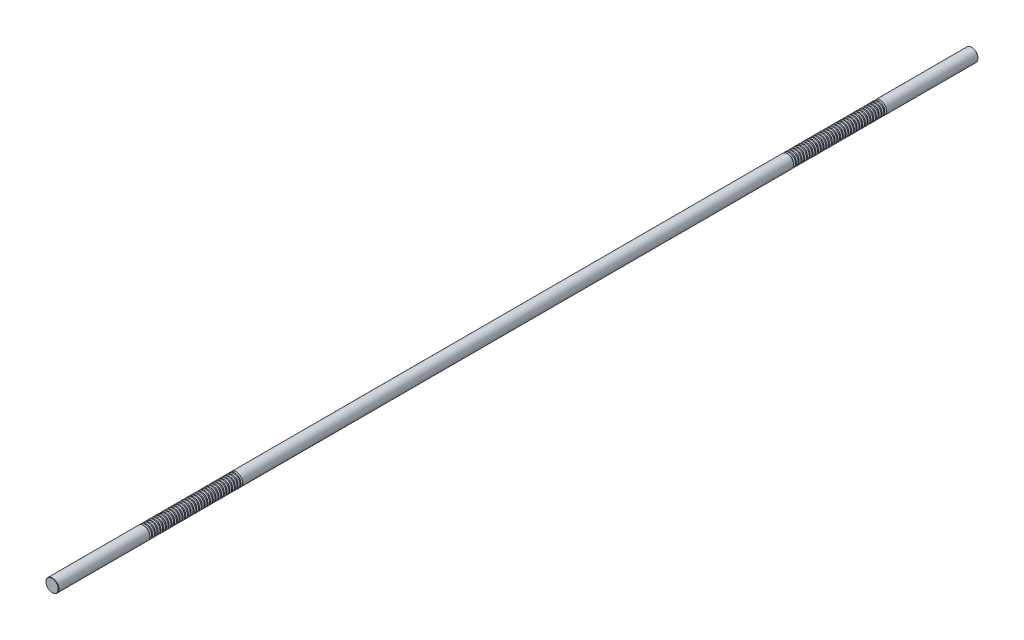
from build123d import *

# Parameters (mm, degrees)
SKETCH1_R           = 7
BOSS_EXTRUDE1_DEPTH = 500
CHAMFER1_SIZE       = 0.35
LPATTERN1_COUNT     = 34
LPATTERN1_PITCH     = 3
LPATTERN2_COUNT     = 2
LPATTERN2_PITCH     = 700


with BuildPart() as part:
    # Sketch1 → Boss-Extrude1 (new, symmetric)
    with BuildSketch(Plane.XY):
        Circle(SKETCH1_R)
    extrude(amount=BOSS_EXTRUDE1_DEPTH, both=True)

    # Chamfer1
    chamfer1_edges = [part.edges().sort_by_distance(p)[0] for p in [
        (-7, 0, -500),
        (-7, 0, 500),
    ]]
    chamfer(chamfer1_edges, length=CHAMFER1_SIZE)

    # Sketch2 → Cut-Revolve1 (revolve, cut)
    with BuildSketch(Plane(origin=(0, 0, 0), x_dir=(0, 0, -1), z_dir=(1, 0, 0)), mode=Mode.PRIVATE) as cut_revolve1_sk:
        Polygon((400.234455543, 7), (398.265544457, 7), (398.734455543, 5.25), (399.765544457, 5.25), align=None)
    cut_revolve1 = revolve(cut_revolve1_sk.sketch.rotate(Axis((0, 0, 500), (0, 0, -1)), 90), axis=Axis((0, 0, 500), (0, 0, -1)), mode=Mode.SUBTRACT)

    # LPattern1: Cut-Revolve1 ×34
    with Locations(*[(0, 0, i * LPATTERN1_PITCH) for i in range(1, LPATTERN1_COUNT)]):
        add(cut_revolve1, mode=Mode.SUBTRACT)

    # LPattern2: Cut-Revolve1 ×2
    with Locations(*[(0, 0, i * LPATTERN2_PITCH) for i in range(1, LPATTERN2_COUNT)]):
        add(cut_revolve1, mode=Mode.SUBTRACT)

    # LPattern2 copy 1 sketch → LPattern2 copy 1 (revolve, cut)
    with BuildSketch(Plane(origin=(0, 0, 703), x_dir=(0, 0, -1), z_dir=(1, 0, 0))):
        Polygon((400.234455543, 7), (398.265544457, 7), (398.734455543, 5.25), (399.765544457, 5.25), align=None)
    revolve(axis=Axis((0, 0, 1203), (0, 0, -1)), mode=Mode.SUBTRACT)

    # LPattern2 copy 2 sketch → LPattern2 copy 2 (revolve, cut)
    with BuildSketch(Plane(origin=(0, 0, 706), x_dir=(0, 0, -1), z_dir=(1, 0, 0))):
        Polygon((400.234455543, 7), (398.265544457, 7), (398.734455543, 5.25), (399.765544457, 5.25), align=None)
    revolve(axis=Axis((0, 0, 1206), (0, 0, -1)), mode=Mode.SUBTRACT)

    # LPattern2 copy 3 sketch → LPattern2 copy 3 (revolve, cut)
    with BuildSketch(Plane(origin=(0, 0, 709), x_dir=(0, 0, -1), z_dir=(1, 0, 0))):
        Polygon((400.234455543, 7), (398.265544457, 7), (398.734455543, 5.25), (399.765544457, 5.25), align=None)
    revolve(axis=Axis((0, 0, 1209), (0, 0, -1)), mode=Mode.SUBTRACT)

    # LPattern2 copy 4 sketch → LPattern2 copy 4 (revolve, cut)
    with BuildSketch(Plane(origin=(0, 0, 712), x_dir=(0, 0, -1), z_dir=(1, 0, 0))):
        Polygon((400.234455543, 7), (398.265544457, 7), (398.734455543, 5.25), (399.765544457, 5.25), align=None)
    revolve(axis=Axis((0, 0, 1212), (0, 0, -1)), mode=Mode.SUBTRACT)

    # LPattern2 copy 5 sketch → LPattern2 copy 5 (revolve, cut)
    with BuildSketch(Plane(origin=(0, 0, 715), x_dir=(0, 0, -1), z_dir=(1, 0, 0))):
        Polygon((400.234455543, 7), (398.265544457, 7), (398.734455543, 5.25), (399.765544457, 5.25), align=None)
    revolve(axis=Axis((0, 0, 1215), (0, 0, -1)), mode=Mode.SUBTRACT)

    # LPattern2 copy 6 sketch → LPattern2 copy 6 (revolve, cut)
    with BuildSketch(Plane(origin=(0, 0, 718), x_dir=(0, 0, -1), z_dir=(1, 0, 0))):
        Polygon((400.234455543, 7), (398.265544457, 7), (398.734455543, 5.25), (399.765544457, 5.25), align=None)
    revolve(axis=Axis((0, 0, 1218), (0, 0, -1)), mode=Mode.SUBTRACT)

    # LPattern2 copy 7 sketch → LPattern2 copy 7 (revolve, cut)
    with BuildSketch(Plane(origin=(0, 0, 721), x_dir=(0, 0, -1), z_dir=(1, 0, 0))):
        Polygon((400.234455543, 7), (398.265544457, 7), (398.734455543, 5.25), (399.765544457, 5.25), align=None)
    revolve(axis=Axis((0, 0, 1221), (0, 0, -1)), mode=Mode.SUBTRACT)

    # LPattern2 copy 8 sketch → LPattern2 copy 8 (revolve, cut)
    with BuildSketch(Plane(origin=(0, 0, 724), x_dir=(0, 0, -1), z_dir=(1, 0, 0))):
        Polygon((400.234455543, 7), (398.265544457, 7), (398.734455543, 5.25), (399.765544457, 5.25), align=None)
    revolve(axis=Axis((0, 0, 1224), (0, 0, -1)), mode=Mode.SUBTRACT)

    # LPattern2 copy 9 sketch → LPattern2 copy 9 (revolve, cut)
    with BuildSketch(Plane(origin=(0, 0, 727), x_dir=(0, 0, -1), z_dir=(1, 0, 0))):
        Polygon((400.234455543, 7), (398.265544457, 7), (398.734455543, 5.25), (399.765544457, 5.25), align=None)
    revolve(axis=Axis((0, 0, 1227), (0, 0, -1)), mode=Mode.SUBTRACT)

    # LPattern2 copy 10 sketch → LPattern2 copy 10 (revolve, cut)
    with BuildSketch(Plane(origin=(0, 0, 730), x_dir=(0, 0, -1), z_dir=(1, 0, 0))):
        Polygon((400.234455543, 7), (398.265544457, 7), (398.734455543, 5.25), (399.765544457, 5.25), align=None)
    revolve(axis=Axis((0, 0, 1230), (0, 0, -1)), mode=Mode.SUBTRACT)

    # LPattern2 copy 11 sketch → LPattern2 copy 11 (revolve, cut)
    with BuildSketch(Plane(origin=(0, 0, 733), x_dir=(0, 0, -1), z_dir=(1, 0, 0))):
        Polygon((400.234455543, 7), (398.265544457, 7), (398.734455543, 5.25), (399.765544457, 5.25), align=None)
    revolve(axis=Axis((0, 0, 1233), (0, 0, -1)), mode=Mode.SUBTRACT)

    # LPattern2 copy 12 sketch → LPattern2 copy 12 (revolve, cut)
    with BuildSketch(Plane(origin=(0, 0, 736), x_dir=(0, 0, -1), z_dir=(1, 0, 0))):
        Polygon((400.234455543, 7), (398.265544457, 7), (398.734455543, 5.25), (399.765544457, 5.25), align=None)
    revolve(axis=Axis((0, 0, 1236), (0, 0, -1)), mode=Mode.SUBTRACT)

    # LPattern2 copy 13 sketch → LPattern2 copy 13 (revolve, cut)
    with BuildSketch(Plane(origin=(0, 0, 739), x_dir=(0, 0, -1), z_dir=(1, 0, 0))):
        Polygon((400.234455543, 7), (398.265544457, 7), (398.734455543, 5.25), (399.765544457, 5.25), align=None)
    revolve(axis=Axis((0, 0, 1239), (0, 0, -1)), mode=Mode.SUBTRACT)

    # LPattern2 copy 14 sketch → LPattern2 copy 14 (revolve, cut)
    with BuildSketch(Plane(origin=(0, 0, 742), x_dir=(0, 0, -1), z_dir=(1, 0, 0))):
        Polygon((400.234455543, 7), (398.265544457, 7), (398.734455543, 5.25), (399.765544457, 5.25), align=None)
    revolve(axis=Axis((0, 0, 1242), (0, 0, -1)), mode=Mode.SUBTRACT)

    # LPattern2 copy 15 sketch → LPattern2 copy 15 (revolve, cut)
    with BuildSketch(Plane(origin=(0, 0, 745), x_dir=(0, 0, -1), z_dir=(1, 0, 0))):
        Polygon((400.234455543, 7), (398.265544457, 7), (398.734455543, 5.25), (399.765544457, 5.25), align=None)
    revolve(axis=Axis((0, 0, 1245), (0, 0, -1)), mode=Mode.SUBTRACT)

    # LPattern2 copy 16 sketch → LPattern2 copy 16 (revolve, cut)
    with BuildSketch(Plane(origin=(0, 0, 748), x_dir=(0, 0, -1), z_dir=(1, 0, 0))):
        Polygon((400.234455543, 7), (398.265544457, 7), (398.734455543, 5.25), (399.765544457, 5.25), align=None)
    revolve(axis=Axis((0, 0, 1248), (0, 0, -1)), mode=Mode.SUBTRACT)

    # LPattern2 copy 17 sketch → LPattern2 copy 17 (revolve, cut)
    with BuildSketch(Plane(origin=(0, 0, 751), x_dir=(0, 0, -1), z_dir=(1, 0, 0))):
        Polygon((400.234455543, 7), (398.265544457, 7), (398.734455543, 5.25), (399.765544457, 5.25), align=None)
    revolve(axis=Axis((0, 0, 1251), (0, 0, -1)), mode=Mode.SUBTRACT)

    # LPattern2 copy 18 sketch → LPattern2 copy 18 (revolve, cut)
    with BuildSketch(Plane(origin=(0, 0, 754), x_dir=(0, 0, -1), z_dir=(1, 0, 0))):
        Polygon((400.234455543, 7), (398.265544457, 7), (398.734455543, 5.25), (399.765544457, 5.25), align=None)
    revolve(axis=Axis((0, 0, 1254), (0, 0, -1)), mode=Mode.SUBTRACT)

    # LPattern2 copy 19 sketch → LPattern2 copy 19 (revolve, cut)
    with BuildSketch(Plane(origin=(0, 0, 757), x_dir=(0, 0, -1), z_dir=(1, 0, 0))):
        Polygon((400.234455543, 7), (398.265544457, 7), (398.734455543, 5.25), (399.765544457, 5.25), align=None)
    revolve(axis=Axis((0, 0, 1257), (0, 0, -1)), mode=Mode.SUBTRACT)

    # LPattern2 copy 20 sketch → LPattern2 copy 20 (revolve, cut)
    with BuildSketch(Plane(origin=(0, 0, 760), x_dir=(0, 0, -1), z_dir=(1, 0, 0))):
        Polygon((400.234455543, 7), (398.265544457, 7), (398.734455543, 5.25), (399.765544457, 5.25), align=None)
    revolve(axis=Axis((0, 0, 1260), (0, 0, -1)), mode=Mode.SUBTRACT)

    # LPattern2 copy 21 sketch → LPattern2 copy 21 (revolve, cut)
    with BuildSketch(Plane(origin=(0, 0, 763), x_dir=(0, 0, -1), z_dir=(1, 0, 0))):
        Polygon((400.234455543, 7), (398.265544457, 7), (398.734455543, 5.25), (399.765544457, 5.25), align=None)
    revolve(axis=Axis((0, 0, 1263), (0, 0, -1)), mode=Mode.SUBTRACT)

    # LPattern2 copy 22 sketch → LPattern2 copy 22 (revolve, cut)
    with BuildSketch(Plane(origin=(0, 0, 766), x_dir=(0, 0, -1), z_dir=(1, 0, 0))):
        Polygon((400.234455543, 7), (398.265544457, 7), (398.734455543, 5.25), (399.765544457, 5.25), align=None)
    revolve(axis=Axis((0, 0, 1266), (0, 0, -1)), mode=Mode.SUBTRACT)

    # LPattern2 copy 23 sketch → LPattern2 copy 23 (revolve, cut)
    with BuildSketch(Plane(origin=(0, 0, 769), x_dir=(0, 0, -1), z_dir=(1, 0, 0))):
        Polygon((400.234455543, 7), (398.265544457, 7), (398.734455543, 5.25), (399.765544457, 5.25), align=None)
    revolve(axis=Axis((0, 0, 1269), (0, 0, -1)), mode=Mode.SUBTRACT)

    # LPattern2 copy 24 sketch → LPattern2 copy 24 (revolve, cut)
    with BuildSketch(Plane(origin=(0, 0, 772), x_dir=(0, 0, -1), z_dir=(1, 0, 0))):
        Polygon((400.234455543, 7), (398.265544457, 7), (398.734455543, 5.25), (399.765544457, 5.25), align=None)
    revolve(axis=Axis((0, 0, 1272), (0, 0, -1)), mode=Mode.SUBTRACT)

    # LPattern2 copy 25 sketch → LPattern2 copy 25 (revolve, cut)
    with BuildSketch(Plane(origin=(0, 0, 775), x_dir=(0, 0, -1), z_dir=(1, 0, 0))):
        Polygon((400.234455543, 7), (398.265544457, 7), (398.734455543, 5.25), (399.765544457, 5.25), align=None)
    revolve(axis=Axis((0, 0, 1275), (0, 0, -1)), mode=Mode.SUBTRACT)

    # LPattern2 copy 26 sketch → LPattern2 copy 26 (revolve, cut)
    with BuildSketch(Plane(origin=(0, 0, 778), x_dir=(0, 0, -1), z_dir=(1, 0, 0))):
        Polygon((400.234455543, 7), (398.265544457, 7), (398.734455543, 5.25), (399.765544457, 5.25), align=None)
    revolve(axis=Axis((0, 0, 1278), (0, 0, -1)), mode=Mode.SUBTRACT)

    # LPattern2 copy 27 sketch → LPattern2 copy 27 (revolve, cut)
    with BuildSketch(Plane(origin=(0, 0, 781), x_dir=(0, 0, -1), z_dir=(1, 0, 0))):
        Polygon((400.234455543, 7), (398.265544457, 7), (398.734455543, 5.25), (399.765544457, 5.25), align=None)
    revolve(axis=Axis((0, 0, 1281), (0, 0, -1)), mode=Mode.SUBTRACT)

    # LPattern2 copy 28 sketch → LPattern2 copy 28 (revolve, cut)
    with BuildSketch(Plane(origin=(0, 0, 784), x_dir=(0, 0, -1), z_dir=(1, 0, 0))):
        Polygon((400.234455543, 7), (398.265544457, 7), (398.734455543, 5.25), (399.765544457, 5.25), align=None)
    revolve(axis=Axis((0, 0, 1284), (0, 0, -1)), mode=Mode.SUBTRACT)

    # LPattern2 copy 29 sketch → LPattern2 copy 29 (revolve, cut)
    with BuildSketch(Plane(origin=(0, 0, 787), x_dir=(0, 0, -1), z_dir=(1, 0, 0))):
        Polygon((400.234455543, 7), (398.265544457, 7), (398.734455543, 5.25), (399.765544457, 5.25), align=None)
    revolve(axis=Axis((0, 0, 1287), (0, 0, -1)), mode=Mode.SUBTRACT)

    # LPattern2 copy 30 sketch → LPattern2 copy 30 (revolve, cut)
    with BuildSketch(Plane(origin=(0, 0, 790), x_dir=(0, 0, -1), z_dir=(1, 0, 0))):
        Polygon((400.234455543, 7), (398.265544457, 7), (398.734455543, 5.25), (399.765544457, 5.25), align=None)
    revolve(axis=Axis((0, 0, 1290), (0, 0, -1)), mode=Mode.SUBTRACT)

    # LPattern2 copy 31 sketch → LPattern2 copy 31 (revolve, cut)
    with BuildSketch(Plane(origin=(0, 0, 793), x_dir=(0, 0, -1), z_dir=(1, 0, 0))):
        Polygon((400.234455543, 7), (398.265544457, 7), (398.734455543, 5.25), (399.765544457, 5.25), align=None)
    revolve(axis=Axis((0, 0, 1293), (0, 0, -1)), mode=Mode.SUBTRACT)

    # LPattern2 copy 32 sketch → LPattern2 copy 32 (revolve, cut)
    with BuildSketch(Plane(origin=(0, 0, 796), x_dir=(0, 0, -1), z_dir=(1, 0, 0))):
        Polygon((400.234455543, 7), (398.265544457, 7), (398.734455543, 5.25), (399.765544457, 5.25), align=None)
    revolve(axis=Axis((0, 0, 1296), (0, 0, -1)), mode=Mode.SUBTRACT)

    # LPattern2 copy 33 sketch → LPattern2 copy 33 (revolve, cut)
    with BuildSketch(Plane(origin=(0, 0, 799), x_dir=(0, 0, -1), z_dir=(1, 0, 0))):
        Polygon((400.234455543, 7), (398.265544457, 7), (398.734455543, 5.25), (399.765544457, 5.25), align=None)
    revolve(axis=Axis((0, 0, 1299), (0, 0, -1)), mode=Mode.SUBTRACT)


solid = part.part
